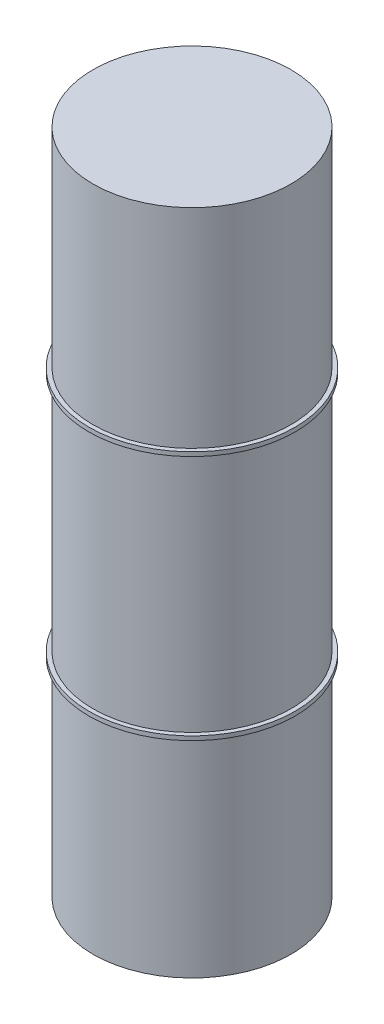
from build123d import *

# Parameters (mm, degrees)
SKETCH1_R           = 4.75
BOSS_EXTRUDE1_DEPTH = 32
SKETCH2_R           = 4.95
BOSS_EXTRUDE2_DEPTH = 0.2
BOSS_EXTRUDE3_START = -0.2
SKETCH3_R           = 4.95
BOSS_EXTRUDE3_DEPTH = 0.2


with BuildPart() as part:
    # Sketch1 → Boss-Extrude1 (new body)
    with BuildSketch(Plane(origin=(0, 0, 0), x_dir=(1, 0, 0), z_dir=(0, 1, 0))):
        with Locations(Location((0, 0, 0), (0, 0, 270))):
            Circle(SKETCH1_R)
    extrude(amount=BOSS_EXTRUDE1_DEPTH)

    # Sketch2 → Boss-Extrude2 (add)
    with BuildSketch(Plane(origin=(0, 10, 0), x_dir=(-1, 0, 0), z_dir=(0, 1, 0))):
        with Locations(Location((0, 0, 0), (0, 0, 90))):
            Circle(SKETCH2_R)
    extrude(amount=BOSS_EXTRUDE2_DEPTH)

    # Sketch3 → Boss-Extrude3 (add)
    with BuildSketch(Plane(origin=(0, 22, 0), x_dir=(-1, 0, 0), z_dir=(0, 1, 0)).offset(BOSS_EXTRUDE3_START)):
        with Locations(Location((0, 0, 0), (0, 0, 90))):
            Circle(SKETCH3_R)
    extrude(amount=BOSS_EXTRUDE3_DEPTH)


solid = part.part
